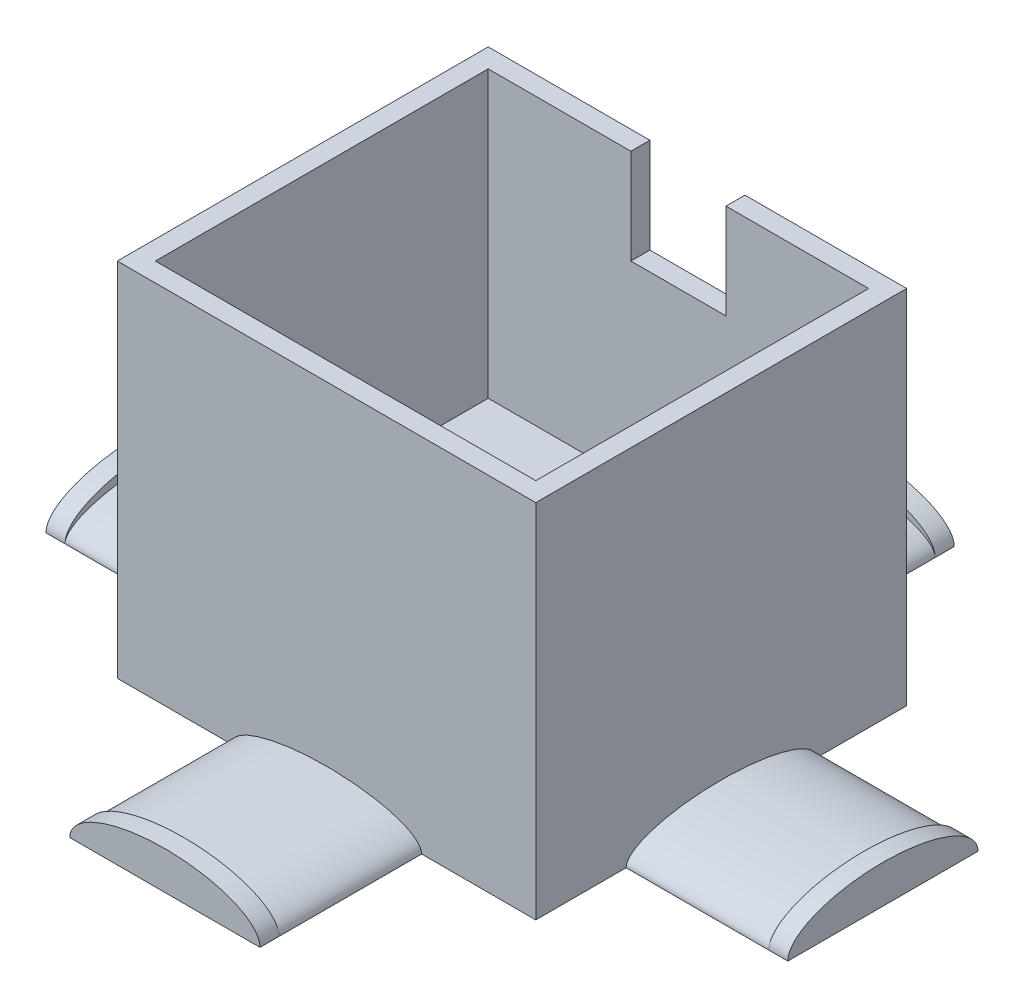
from build123d import *

# Parameters (mm, degrees)
SKETCH1_W            = 44
SKETCH1_H            = 39
BOSS_EXTRUDE1_DEPTH  = 32
SHELL1_T             = -2
SKETCH2_W            = 44
SKETCH2_H            = 39
BOSS_EXTRUDE2_DEPTH  = 6
CUT_EXTRUDE1_DEPTH   = 67.007575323
SKETCH5_R            = 2
CUT_EXTRUDE2_DEPTH   = 67.007575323
BOSS_EXTRUDE4_DEPTH  = 15
BOSS_EXTRUDE5_DEPTH  = 15
BOSS_EXTRUDE6_DEPTH  = 15
BOSS_EXTRUDE7_DEPTH  = 15
SKETCH11_W           = 10
SKETCH11_H           = 10
CUT_EXTRUDE3_DEPTH   = 10
BOSS_EXTRUDE8_DEPTH  = 2
BOSS_EXTRUDE9_DEPTH  = 2
BOSS_EXTRUDE10_DEPTH = 2
BOSS_EXTRUDE11_DEPTH = 2


with BuildPart() as part:
    # Sketch1 → Boss-Extrude1 (new body)
    with BuildSketch(Plane(origin=(0, 0, 0), x_dir=(1, 0, 0), z_dir=(0, 1, 0))):
        with Locations((-22, 19.5)):
            Rectangle(SKETCH1_W, SKETCH1_H)
    extrude(amount=BOSS_EXTRUDE1_DEPTH)

    # Shell1
    shell1_openings = [part.faces().sort_by_distance(p)[0] for p in [
        (-22, 32, -19.5),
    ]]
    offset(amount=SHELL1_T, openings=shell1_openings, kind=Kind.INTERSECTION)

    # Sketch2 → Boss-Extrude2 (add)
    with BuildSketch(Plane.XZ):
        with Locations((-22, -19.5)):
            Rectangle(SKETCH2_W, SKETCH2_H)
    extrude(amount=BOSS_EXTRUDE2_DEPTH)

    # Sketch3 → Cut-Extrude1 (cut, through all)
    with BuildSketch(Plane(origin=(0, 2, 0), x_dir=(1, 0, 0), z_dir=(0, 1, 0))):
        with BuildLine():
            ThreePointArc((-32.795, 25.4), (-31.66362915, 25.86862915), (-31.195, 27))
            Line((-31.195, 27), (-32.795, 27))
            Line((-32.795, 27), (-32.795, 25.4))
        make_face()
        with BuildLine():
            Line((-32.795, 27), (-31.195, 27))
            ThreePointArc((-31.195, 27), (-33.92637085, 28.13137085), (-32.795, 25.4))
            Line((-32.795, 25.4), (-32.795, 27))
        make_face()
        with BuildLine():
            ThreePointArc((-32.795, 25.4), (-31.66362915, 25.86862915), (-31.195, 27))
            Line((-31.195, 27), (-32.795, 27))
            Line((-32.795, 27), (-32.795, 25.4))
        make_face()
        with BuildLine():
            Line((-32.795, 27), (-31.195, 27))
            ThreePointArc((-31.195, 27), (-33.92637085, 28.13137085), (-32.795, 25.4))
            Line((-32.795, 25.4), (-32.795, 27))
        make_face()
        with BuildLine():
            ThreePointArc((-9.605, 27), (-11.205, 28.6), (-12.805, 27))
            Line((-12.805, 27), (-11.205, 27))
            Line((-11.205, 27), (-11.205, 25.4))
            ThreePointArc((-11.205, 25.4), (-10.07362915, 25.86862915), (-9.605, 27))
        make_face()
        with BuildLine():
            Line((-11.205, 27), (-12.805, 27))
            ThreePointArc((-12.805, 27), (-12.33637085, 25.86862915), (-11.205, 25.4))
            Line((-11.205, 25.4), (-11.205, 27))
        make_face()
        with BuildLine():
            ThreePointArc((-9.605, 27), (-11.205, 28.6), (-12.805, 27))
            Line((-12.805, 27), (-11.205, 27))
            Line((-11.205, 27), (-11.205, 25.4))
            ThreePointArc((-11.205, 25.4), (-10.07362915, 25.86862915), (-9.605, 27))
        make_face()
        with BuildLine():
            Line((-11.205, 27), (-12.805, 27))
            ThreePointArc((-12.805, 27), (-12.33637085, 25.86862915), (-11.205, 25.4))
            Line((-11.205, 25.4), (-11.205, 27))
        make_face()
        with BuildLine():
            ThreePointArc((-9.605, 11.76), (-10.07362915, 12.89137085), (-11.205, 13.36))
            Line((-11.205, 13.36), (-11.205, 11.76))
            Line((-11.205, 11.76), (-12.805, 11.76))
            ThreePointArc((-12.805, 11.76), (-11.205, 10.16), (-9.605, 11.76))
        make_face()
        with BuildLine():
            Line((-11.205, 11.76), (-11.205, 13.36))
            ThreePointArc((-11.205, 13.36), (-12.33637085, 12.89137085), (-12.805, 11.76))
            Line((-12.805, 11.76), (-11.205, 11.76))
        make_face()
        with BuildLine():
            ThreePointArc((-9.605, 11.76), (-10.07362915, 12.89137085), (-11.205, 13.36))
            Line((-11.205, 13.36), (-11.205, 11.76))
            Line((-11.205, 11.76), (-12.805, 11.76))
            ThreePointArc((-12.805, 11.76), (-11.205, 10.16), (-9.605, 11.76))
        make_face()
        with BuildLine():
            Line((-11.205, 11.76), (-11.205, 13.36))
            ThreePointArc((-11.205, 13.36), (-12.33637085, 12.89137085), (-12.805, 11.76))
            Line((-12.805, 11.76), (-11.205, 11.76))
        make_face()
        with BuildLine():
            ThreePointArc((-31.195, 11.76), (-31.66362915, 12.89137085), (-32.795, 13.36))
            Line((-32.795, 13.36), (-32.795, 11.76))
            Line((-32.795, 11.76), (-31.195, 11.76))
        make_face()
        with BuildLine():
            Line((-32.795, 11.76), (-32.795, 13.36))
            ThreePointArc((-32.795, 13.36), (-33.92637085, 10.62862915), (-31.195, 11.76))
            Line((-31.195, 11.76), (-32.795, 11.76))
        make_face()
        with BuildLine():
            ThreePointArc((-31.195, 11.76), (-31.66362915, 12.89137085), (-32.795, 13.36))
            Line((-32.795, 13.36), (-32.795, 11.76))
            Line((-32.795, 11.76), (-31.195, 11.76))
        make_face()
        with BuildLine():
            Line((-32.795, 11.76), (-32.795, 13.36))
            ThreePointArc((-32.795, 13.36), (-33.92637085, 10.62862915), (-31.195, 11.76))
            Line((-31.195, 11.76), (-32.795, 11.76))
        make_face()
    extrude(amount=-CUT_EXTRUDE1_DEPTH, mode=Mode.SUBTRACT)

    # Sketch5 → Cut-Extrude2 (cut, through all)
    with BuildSketch(Plane(origin=(0, 2, 0), x_dir=(1, 0, 0), z_dir=(0, 1, 0))):
        with Locations(Location((-32.025, 19, 0), (0, 0, 270))):
            Circle(SKETCH5_R)
        with Locations(Location((-11.975, 19, 0), (0, 0, 270))):
            Circle(SKETCH5_R)
    extrude(amount=-CUT_EXTRUDE2_DEPTH, mode=Mode.SUBTRACT)

    # Sketch7 → Boss-Extrude4 (add)
    with BuildSketch(Plane.XY):
        with BuildLine():
            add(Edge.make_bspline(
                [(-12, -6), (-12, -3), (-22, -3), (-32, -3), (-32, -6)],
                knots=[0, 0, 0, 1.570796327, 1.570796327, 3.141592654, 3.141592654, 3.141592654], degree=2, weights=[1, 0.707106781, 1, 0.707106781, 1]))
            Line((-32, -6), (-12, -6))
        make_face()
    extrude(amount=BOSS_EXTRUDE4_DEPTH)

    # Sketch8 → Boss-Extrude5 (add)
    with BuildSketch(Plane(origin=(0, 0, -39), x_dir=(-1, 0, 0), z_dir=(0, 0, -1))):
        with BuildLine():
            add(Edge.make_bspline(
                [(32, -6), (32, -3), (22, -3), (12, -3), (12, -6)],
                knots=[0, 0, 0, 1.570796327, 1.570796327, 3.141592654, 3.141592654, 3.141592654], degree=2, weights=[1, 0.707106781, 1, 0.707106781, 1]))
            Line((12, -6), (32, -6))
        make_face()
    extrude(amount=BOSS_EXTRUDE5_DEPTH)

    # Sketch9 → Boss-Extrude6 (add)
    with BuildSketch(Plane(origin=(0, 0, 0), x_dir=(0, 0, -1), z_dir=(1, 0, 0))):
        with BuildLine():
            add(Edge.make_bspline(
                [(29.5, -6), (29.5, -3), (19.5, -3), (9.5, -3), (9.5, -6)],
                knots=[0, 0, 0, 1.570796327, 1.570796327, 3.141592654, 3.141592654, 3.141592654], degree=2, weights=[1, 0.707106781, 1, 0.707106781, 1]))
            Line((9.5, -6), (29.5, -6))
        make_face()
    extrude(amount=BOSS_EXTRUDE6_DEPTH)

    # Sketch10 → Boss-Extrude7 (add)
    with BuildSketch(Plane.ZY.offset(44)):
        with BuildLine():
            add(Edge.make_bspline(
                [(-9.5, -6), (-9.5, -3), (-19.5, -3), (-29.5, -3), (-29.5, -6)],
                knots=[3.141592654, 3.141592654, 3.141592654, 4.71238898, 4.71238898, 6.283185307, 6.283185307, 6.283185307], degree=2, weights=[1, 0.707106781, 1, 0.707106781, 1]))
            Line((-29.5, -6), (-9.5, -6))
        make_face()
    extrude(amount=BOSS_EXTRUDE7_DEPTH)

    # Sketch11 → Cut-Extrude3 (cut)
    with BuildSketch(Plane(origin=(0, 0, -39), x_dir=(-1, 0, 0), z_dir=(0, 0, -1))):
        with Locations((22, 27)):
            Rectangle(SKETCH11_W, SKETCH11_H)
    extrude(amount=-CUT_EXTRUDE3_DEPTH, mode=Mode.SUBTRACT)

    # Sketch12 → Boss-Extrude8 (add)
    with BuildSketch(Plane.XY.offset(15)):
        with BuildLine():
            add(Edge.make_bspline(
                [(-12, -6), (-12, -3), (-22, -3), (-32, -3), (-32, -6)],
                knots=[0, 0, 0, 1.570796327, 1.570796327, 3.141592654, 3.141592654, 3.141592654], degree=2, weights=[1, 0.707106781, 1, 0.707106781, 1]))
            Line((-32, -6), (-12, -6))
        make_face()
        with BuildLine():
            add(Edge.make_bspline(
                [(-12, -6), (-12, -2), (-22, -2), (-32, -2), (-32, -6)],
                knots=[0, 0, 0, 1.570796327, 1.570796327, 3.141592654, 3.141592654, 3.141592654], degree=2, weights=[1, 0.707106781, 1, 0.707106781, 1]))
            add(Edge.make_bspline(
                [(-12, -6), (-12, -3), (-22, -3), (-32, -3), (-32, -6)],
                knots=[0, 0, 0, 1.570796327, 1.570796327, 3.141592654, 3.141592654, 3.141592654], degree=2, weights=[1, 0.707106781, 1, 0.707106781, 1]))
        make_face()
    extrude(amount=BOSS_EXTRUDE8_DEPTH)

    # Sketch13 → Boss-Extrude9 (add)
    with BuildSketch(Plane.ZY.offset(59)):
        with BuildLine():
            add(Edge.make_bspline(
                [(-9.5, -6), (-9.5, -3), (-19.5, -3), (-29.5, -3), (-29.5, -6)],
                knots=[0, 0, 0, 1.570796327, 1.570796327, 3.141592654, 3.141592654, 3.141592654], degree=2, weights=[1, 0.707106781, 1, 0.707106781, 1]))
            Line((-29.5, -6), (-9.5, -6))
        make_face()
        with BuildLine():
            add(Edge.make_bspline(
                [(-9.5, -6), (-9.5, -2), (-19.5, -2), (-29.5, -2), (-29.5, -6)],
                knots=[3.141592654, 3.141592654, 3.141592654, 4.71238898, 4.71238898, 6.283185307, 6.283185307, 6.283185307], degree=2, weights=[1, 0.707106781, 1, 0.707106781, 1]))
            add(Edge.make_bspline(
                [(-9.5, -6), (-9.5, -3), (-19.5, -3), (-29.5, -3), (-29.5, -6)],
                knots=[0, 0, 0, 1.570796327, 1.570796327, 3.141592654, 3.141592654, 3.141592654], degree=2, weights=[1, 0.707106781, 1, 0.707106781, 1]))
        make_face()
    extrude(amount=BOSS_EXTRUDE9_DEPTH)

    # Sketch14 → Boss-Extrude10 (add)
    with BuildSketch(Plane(origin=(0, 0, -54), x_dir=(-1, 0, 0), z_dir=(0, 0, -1))):
        with BuildLine():
            add(Edge.make_bspline(
                [(32, -6), (32, -3), (22, -3), (12, -3), (12, -6)],
                knots=[0, 0, 0, 1.570796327, 1.570796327, 3.141592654, 3.141592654, 3.141592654], degree=2, weights=[1, 0.707106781, 1, 0.707106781, 1]))
            Line((12, -6), (32, -6))
        make_face()
        with BuildLine():
            add(Edge.make_bspline(
                [(32, -6), (32, -2), (22, -2), (12, -2), (12, -6)],
                knots=[0, 0, 0, 1.570796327, 1.570796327, 3.141592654, 3.141592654, 3.141592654], degree=2, weights=[1, 0.707106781, 1, 0.707106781, 1]))
            add(Edge.make_bspline(
                [(32, -6), (32, -3), (22, -3), (12, -3), (12, -6)],
                knots=[0, 0, 0, 1.570796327, 1.570796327, 3.141592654, 3.141592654, 3.141592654], degree=2, weights=[1, 0.707106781, 1, 0.707106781, 1]))
        make_face()
    extrude(amount=BOSS_EXTRUDE10_DEPTH)

    # Sketch15 → Boss-Extrude11 (add)
    with BuildSketch(Plane(origin=(15, 0, 0), x_dir=(0, 0, -1), z_dir=(1, 0, 0))):
        with BuildLine():
            add(Edge.make_bspline(
                [(29.5, -6), (29.5, -3), (19.5, -3), (9.5, -3), (9.5, -6)],
                knots=[0, 0, 0, 1.570796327, 1.570796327, 3.141592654, 3.141592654, 3.141592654], degree=2, weights=[1, 0.707106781, 1, 0.707106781, 1]))
            Line((9.5, -6), (29.5, -6))
        make_face()
        with BuildLine():
            add(Edge.make_bspline(
                [(29.5, -6), (29.5, -2), (19.5, -2), (9.5, -2), (9.5, -6)],
                knots=[0, 0, 0, 1.570796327, 1.570796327, 3.141592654, 3.141592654, 3.141592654], degree=2, weights=[1, 0.707106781, 1, 0.707106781, 1]))
            add(Edge.make_bspline(
                [(29.5, -6), (29.5, -3), (19.5, -3), (9.5, -3), (9.5, -6)],
                knots=[0, 0, 0, 1.570796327, 1.570796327, 3.141592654, 3.141592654, 3.141592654], degree=2, weights=[1, 0.707106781, 1, 0.707106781, 1]))
        make_face()
    extrude(amount=BOSS_EXTRUDE11_DEPTH)


solid = part.part
